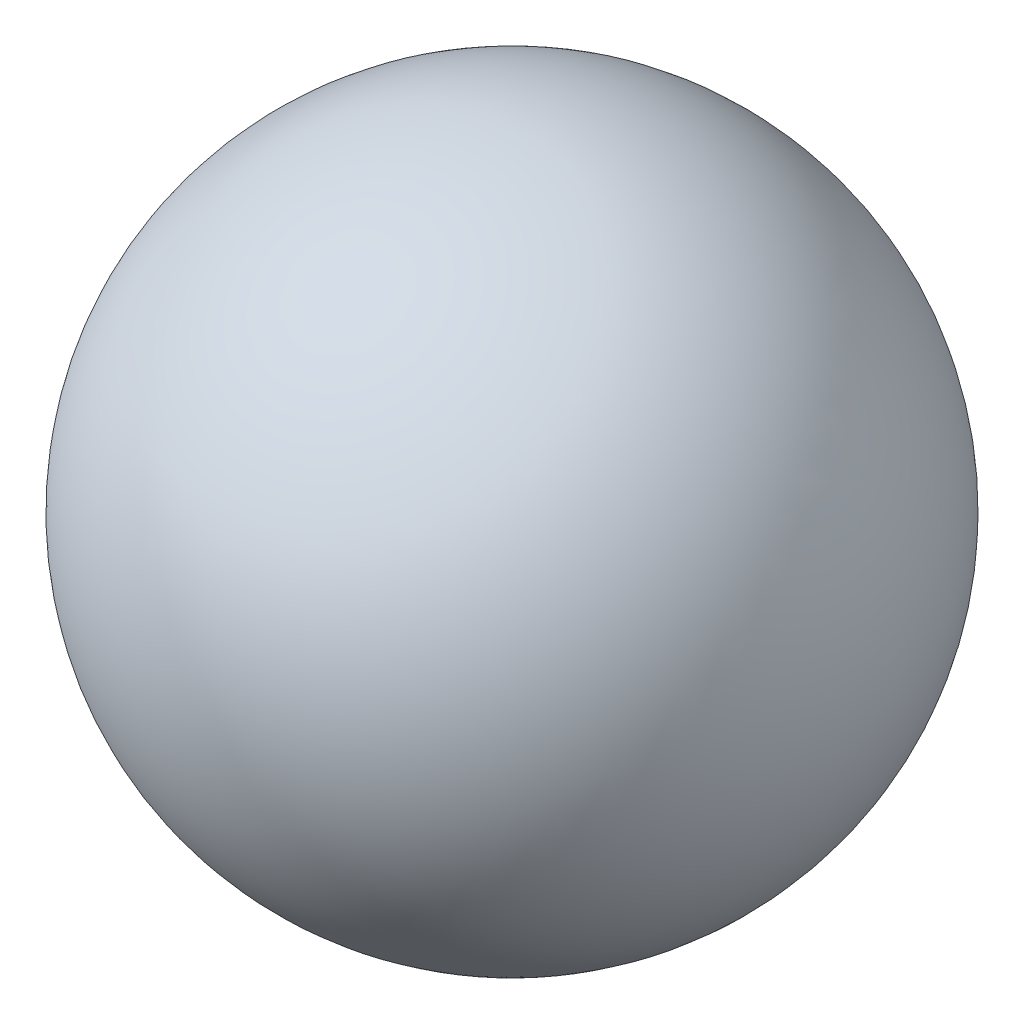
ISO-10303-21;
HEADER;
FILE_DESCRIPTION(('STEP AP214'),'2;1');
FILE_NAME('part.step','',(''),(''),'','','');
FILE_SCHEMA(('AUTOMOTIVE_DESIGN { 1 0 10303 214 1 1 1 1 }'));
ENDSEC;
DATA;
#1=APPLICATION_CONTEXT('core data for automotive mechanical design processes');
#2=APPLICATION_PROTOCOL_DEFINITION('international standard','automotive_design',2000,#1);
#3=PRODUCT_CONTEXT('',#1,'mechanical');
#4=PRODUCT('Part','Part','',(#3));
#5=PRODUCT_RELATED_PRODUCT_CATEGORY('part','',(#4));
#6=PRODUCT_DEFINITION_FORMATION('','',#4);
#7=PRODUCT_DEFINITION_CONTEXT('part definition',#1,'design');
#8=PRODUCT_DEFINITION('design','',#6,#7);
#9=PRODUCT_DEFINITION_SHAPE('','',#8);
#10=(LENGTH_UNIT() NAMED_UNIT(*) SI_UNIT(.MILLI.,.METRE.));
#11=(NAMED_UNIT(*) PLANE_ANGLE_UNIT() SI_UNIT($,.RADIAN.));
#12=(NAMED_UNIT(*) SI_UNIT($,.STERADIAN.) SOLID_ANGLE_UNIT());
#13=UNCERTAINTY_MEASURE_WITH_UNIT(LENGTH_MEASURE(1.E-05),#10,'distance_accuracy_value','');
#14=(GEOMETRIC_REPRESENTATION_CONTEXT(3) GLOBAL_UNCERTAINTY_ASSIGNED_CONTEXT((#13)) GLOBAL_UNIT_ASSIGNED_CONTEXT((#10,
#11,#12)) REPRESENTATION_CONTEXT('',''));
#15=CARTESIAN_POINT('',(0.,0.,0.));
#16=DIRECTION('',(0.,0.,1.));
#17=DIRECTION('',(1.,0.,0.));
#18=AXIS2_PLACEMENT_3D('',#15,#16,#17);
#19=CARTESIAN_POINT('',(0.,0.,0.));
#20=DIRECTION('',(0.,1.,0.));
#21=DIRECTION('',(1.,0.,0.));
#22=AXIS2_PLACEMENT_3D('',#19,#20,#21);
#23=SPHERICAL_SURFACE('',#22,192.3);
#24=CARTESIAN_POINT('',(0.,-191.130795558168,0.));
#25=DIRECTION('',(0.,1.,0.));
#26=DIRECTION('',(0.,0.,1.));
#27=AXIS2_PLACEMENT_3D('',#24,#25,#26);
#28=CIRCLE('',#27,21.1733084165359);
#29=CARTESIAN_POINT('',(0.,-191.130795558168,21.1733084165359));
#30=VERTEX_POINT('',#29);
#31=EDGE_CURVE('E49',#30,#30,#28,.T.);
#32=ORIENTED_EDGE('',*,*,#31,.F.);
#33=EDGE_LOOP('',(#32));
#34=FACE_BOUND('',#33,.T.);
#35=ADVANCED_FACE('F45',(#34),#23,.F.);
#36=CARTESIAN_POINT('',(0.,-202.3,0.));
#37=DIRECTION('',(0.,1.,0.));
#38=DIRECTION('',(0.,0.,1.));
#39=AXIS2_PLACEMENT_3D('',#36,#37,#38);
#40=CYLINDRICAL_SURFACE('',#39,21.1733084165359);
#41=ORIENTED_EDGE('',*,*,#31,.T.);
#42=EDGE_LOOP('',(#41));
#43=FACE_BOUND('',#42,.T.);
#44=CARTESIAN_POINT('',(0.,-201.188918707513,0.));
#45=DIRECTION('',(0.,1.,0.));
#46=DIRECTION('',(0.,0.,1.));
#47=AXIS2_PLACEMENT_3D('',#44,#45,#46);
#48=CIRCLE('',#47,21.1733084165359);
#49=CARTESIAN_POINT('',(0.,-201.188918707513,21.1733084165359));
#50=VERTEX_POINT('',#49);
#51=EDGE_CURVE('E10',#50,#50,#48,.T.);
#52=ORIENTED_EDGE('',*,*,#51,.F.);
#53=EDGE_LOOP('',(#52));
#54=FACE_BOUND('',#53,.T.);
#55=ADVANCED_FACE('F60',(#43,#54),#40,.F.);
#56=CARTESIAN_POINT('',(0.,0.,0.));
#57=DIRECTION('',(0.,1.,0.));
#58=DIRECTION('',(1.,0.,0.));
#59=AXIS2_PLACEMENT_3D('',#56,#57,#58);
#60=SPHERICAL_SURFACE('',#59,202.3);
#61=ORIENTED_EDGE('',*,*,#51,.T.);
#62=EDGE_LOOP('',(#61));
#63=FACE_BOUND('',#62,.T.);
#64=ADVANCED_FACE('F47',(#63),#60,.T.);
#65=CLOSED_SHELL('',(#35,#55,#64));
#66=MANIFOLD_SOLID_BREP('B2',#65);
#67=ADVANCED_BREP_SHAPE_REPRESENTATION('',(#18,#66),#14);
#68=SHAPE_DEFINITION_REPRESENTATION(#9,#67);
ENDSEC;
END-ISO-10303-21;
